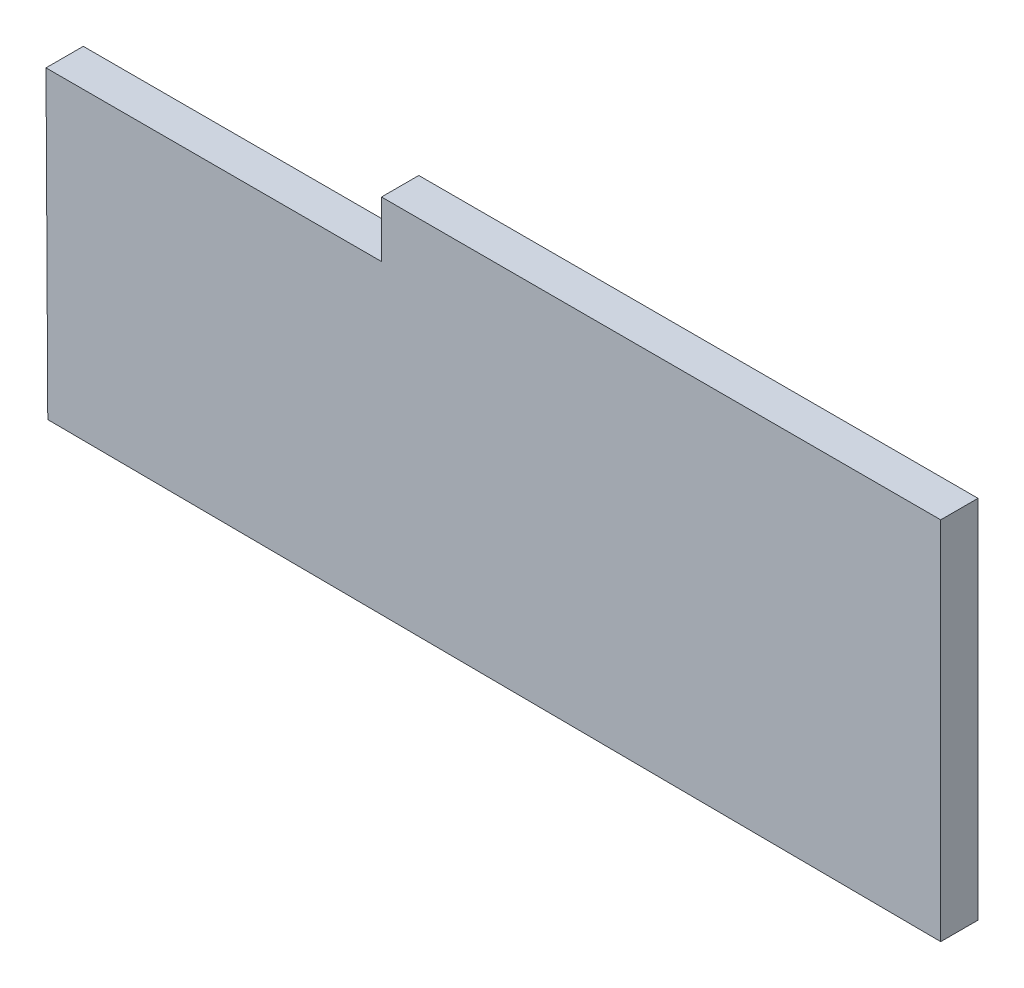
from build123d import *

# Parameters (mm, degrees)
SALIENTE_EXTRUIR1_DEPTH = 1
CROQUIS2_W              = 5
CROQUIS2_H              = 1
SALIENTE_EXTRUIR2_DEPTH = 1
VACIADO1_T              = -0.15


with BuildPart() as part:
    # Croquis1 → Saliente-Extruir1 (new body)
    with BuildSketch(Plane.XY):
        Polygon((8, 12.5), (-7, 12.5), (-7, 11), (-16, 11), (-15.952152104, 2.852031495), (8, 2.7), align=None)
    extrude(amount=SALIENTE_EXTRUIR1_DEPTH)


with BuildPart() as body_2:
    # Croquis2 → Saliente-Extruir2 (new body)
    with BuildSketch(Plane(origin=(0, 0, 0), x_dir=(-1, 0, 0), z_dir=(0, 0, -1))):
        with Locations((11.988186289, 9)):
            Rectangle(CROQUIS2_W, CROQUIS2_H)
    extrude(amount=SALIENTE_EXTRUIR2_DEPTH)

    # Vaciado1
    vaciado1_openings = [body_2.faces().sort_by_distance(p)[0] for p in [
        (-11.988186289, 8.5, -0.5),
    ]]
    offset(amount=VACIADO1_T, openings=vaciado1_openings, kind=Kind.INTERSECTION)

    # Combinar1: union part
    add(part.part)


solid = body_2.part
